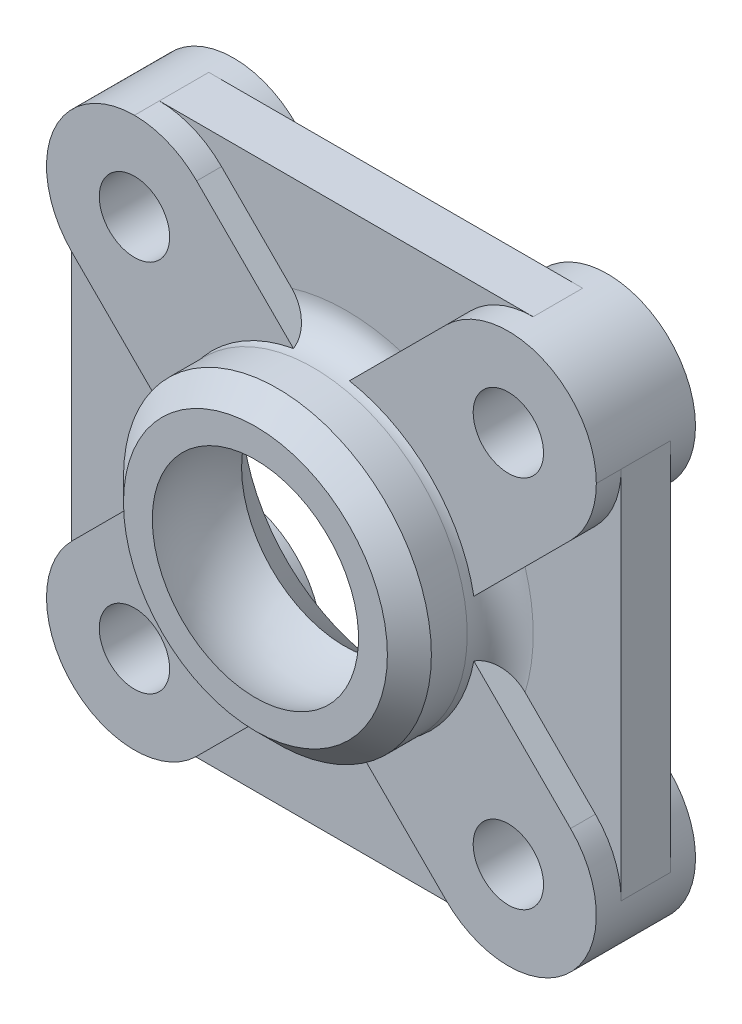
from build123d import *
from build123d.topology import SkipClean

# Parameters (mm, degrees)
ESQUISSE1_R                  = 1.6
BOSS_EXTRU_1_DEPTH           = 2.25
ESQUISSE2_R                  = 7
BOSS_EXTRU_2_DEPTH           = 4.13
CHANFREIN1_SIZE              = 1
BOSS_EXTRU_3_START           = 1.13
ESQUISSE6_R                  = 4
ESQUISSE6_R_2                = 1.6
BOSS_EXTRU_3_DEPTH           = 1.13
R_P_TITION_CIRCULAIRE1_COUNT = 4
ESQUISSE8_R                  = 1.6
BOSS_EXTRU_4_DEPTH           = 1.13
R_P_TITION_CIRCULAIRE2_COUNT = 4


with BuildPart() as part:
    # Esquisse1 → Boss.-Extru.1 (new body)
    with BuildSketch(Plane.XY):
        with BuildLine():
            Line((-8.5, 12.5), (8.5, 12.5))
            ThreePointArc((8.5, 12.5), (11.328427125, 11.328427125), (12.5, 8.5))
            Line((12.5, 8.5), (12.5, -8.5))
            ThreePointArc((12.5, -8.5), (11.328427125, -11.328427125), (8.5, -12.5))
            Line((8.5, -12.5), (-8.5, -12.5))
            ThreePointArc((-8.5, -12.5), (-11.328427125, -11.328427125), (-12.5, -8.5))
            Line((-12.5, -8.5), (-12.5, 8.5))
            ThreePointArc((-12.5, 8.5), (-11.328427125, 11.328427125), (-8.5, 12.5))
        make_face()
        with Locations((-8.5, 8.5)):
            Circle(ESQUISSE1_R, mode=Mode.SUBTRACT)
        with Locations((8.5, 8.5)):
            Circle(ESQUISSE1_R, mode=Mode.SUBTRACT)
        with Locations((-8.5, -8.5)):
            Circle(ESQUISSE1_R, mode=Mode.SUBTRACT)
        with Locations((8.5, -8.5)):
            Circle(ESQUISSE1_R, mode=Mode.SUBTRACT)
    extrude(amount=BOSS_EXTRU_1_DEPTH)

    # Esquisse2 → Boss.-Extru.2 (add)
    with BuildSketch(Plane.XY.offset(2.25)):
        Circle(ESQUISSE2_R)
    extrude(amount=BOSS_EXTRU_2_DEPTH)

    # Chanfrein1
    chanfrein1_edges = [part.edges().sort_by_distance(p)[0] for p in [
        (-7, 0, 6.38),
    ]]
    chamfer(chanfrein1_edges, length=CHANFREIN1_SIZE)

    # Esquisse3 → Enl_vement de mati_re-R_volution2 (revolve, cut)
    with BuildSketch(Plane(origin=(0, 0, 0), x_dir=(1, 0, 0), z_dir=(0, 1, 0))):
        with BuildLine():
            Line((0, -6.38), (-4.689477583, -6.38))
            ThreePointArc((-4.689477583, -6.38), (-5.11, -4.35), (-4.689477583, -2.32))
            Line((-4.689477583, -2.32), (-7.009477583, 0))
            Line((-7.009477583, 0), (0, 0))
            Line((0, 0), (0, -6.38))
        make_face()
    revolve(axis=Axis((0, 0, -7.226150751), (0, 0, 1)), mode=Mode.SUBTRACT)

    # Esquisse6 → Boss.-Extru.3 (add)
    with SkipClean():  # the faces are left unmerged after this step: merging them gives an invalid solid
        with BuildSketch(Plane(origin=(0, 0, 0), x_dir=(-1, 0, 0), z_dir=(0, 0, -1)).offset(BOSS_EXTRU_3_START)):
            with Locations((8.5, -8.5)):
                Circle(ESQUISSE6_R)
            with Locations((8.5, -8.5)):
                Circle(ESQUISSE6_R_2, mode=Mode.SUBTRACT)
        boss_extru_3 = extrude(amount=-BOSS_EXTRU_3_DEPTH)

    # R_p_tition circulaire1: Boss.-Extru.3 ×4 about axis
    with SkipClean():  # the faces are left unmerged after this step: merging them gives an invalid solid
        r_p_tition_circulaire1_axis = Axis((0, 0, 0), (0, 0, 1))
        for i in range(1, R_P_TITION_CIRCULAIRE1_COUNT):
            add(boss_extru_3.rotate(r_p_tition_circulaire1_axis, i * 360 / R_P_TITION_CIRCULAIRE1_COUNT))

    # Esquisse8 → Boss.-Extru.4 (add)
    with SkipClean():  # the faces are left unmerged after this step: merging them gives an invalid solid
        with BuildSketch(Plane.XY.offset(2.25)):
            with BuildLine():
                Line((-11.328427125, -5.671572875), (-6.890446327, -1.233592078))
                ThreePointArc((-6.890446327, -1.233592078), (-4.949747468, -4.949747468), (-1.233592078, -6.890446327))
                Line((-1.233592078, -6.890446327), (-5.671572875, -11.328427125))
                ThreePointArc((-5.671572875, -11.328427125), (-11.328427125, -11.328427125), (-11.328427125, -5.671572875))
            make_face()
            with Locations(Location((-8.5, -8.5, 0), (0, 0, 180))):
                Circle(ESQUISSE8_R, mode=Mode.SUBTRACT)
        boss_extru_4 = extrude(amount=BOSS_EXTRU_4_DEPTH)

    # R_p_tition circulaire2: Boss.-Extru.4 ×4 about axis
    with SkipClean():  # the faces are left unmerged after this step: merging them gives an invalid solid
        r_p_tition_circulaire2_axis = Axis((0, 0, 0), (0, 0, 1))
        for i in range(1, R_P_TITION_CIRCULAIRE2_COUNT):
            add(boss_extru_4.rotate(r_p_tition_circulaire2_axis, i * 360 / R_P_TITION_CIRCULAIRE2_COUNT))

    # Esquisse10 → R_volution1 (revolve)
    with SkipClean():  # the faces are left unmerged after this step: merging them gives an invalid solid
        with BuildSketch(Plane(origin=(0, 0, 0), x_dir=(0, 0, -1), z_dir=(1, 0, 0)), mode=Mode.PRIVATE) as r_volution1_sk:
            with BuildLine():
                Line((-2.25, 7), (-2.25, 8.5))
                ThreePointArc((-2.25, 8.5), (-2.689339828, 7.439339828), (-3.75, 7))
                Line((-3.75, 7), (-2.25, 7))
            make_face()
        revolve(r_volution1_sk.sketch.rotate(Axis((0, 0, 6.38), (0, 0, -1)), 90), axis=Axis((0, 0, 6.38), (0, 0, -1)))


solid = part.part
